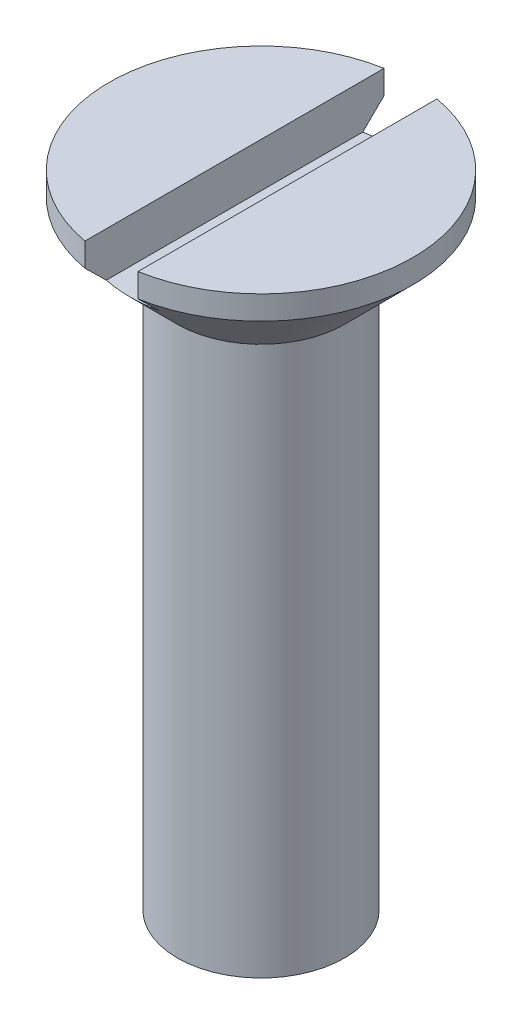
from build123d import *

# Parameters (mm, degrees)
SKETCH2_W          = 1.9
SKETCH2_H          = 1.6
CUT_EXTRUDE2_DEPTH = 6


with BuildPart() as part:
    # Sketch1 → Revolve1 (revolve)
    with BuildSketch(Plane.XY, mode=Mode.PRIVATE) as revolve1_sk:
        Polygon((0, 0), (0, 24.732050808), (5.45, 24.732050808), (5.45, 23.882050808), (3, 21.432050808), (3, 1.732050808), align=None)
    revolve(revolve1_sk.sketch.rotate(Axis((0, 30.123486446, 0), (0, -1, 0)), 90), axis=Axis((0, 30.123486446, 0), (0, -1, 0)))

    # Sketch2 → Cut-Extrude2 (cut, symmetric)
    with BuildSketch(Plane.XY):
        with Locations((0, 23.932050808)):
            Rectangle(SKETCH2_W, SKETCH2_H)
    extrude(amount=CUT_EXTRUDE2_DEPTH, both=True, mode=Mode.SUBTRACT)


solid = part.part
